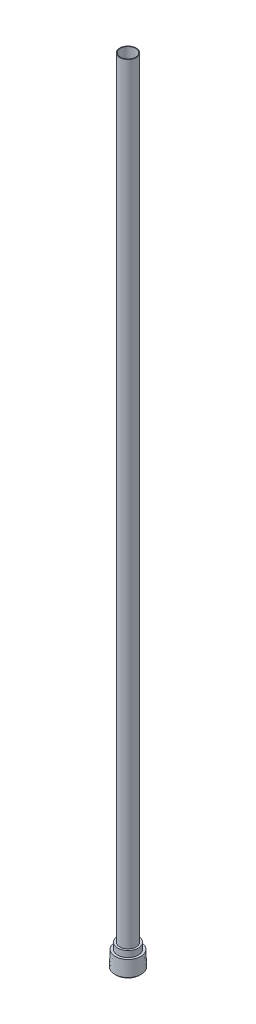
from build123d import *

# Parameters (mm, degrees)
CUT_EXTRUDE2_DEPTH = 4.7498
SKETCH2_R          = 2.921
CUT_EXTRUDE1_DEPTH = 300.0502
CHAMFER1_SIZE      = 0.508
CHAMFER1_SIZE2     = 0.49045616


with BuildPart() as part:
    # Sketch1 → Revolve1 (revolve)
    with BuildSketch(Plane(origin=(0, 0, 0), x_dir=(0, 0, -1), z_dir=(1, 0, 0)), mode=Mode.PRIVATE) as revolve1_sk:
        Polygon((0, 304.8), (0, 0), (5.0927, 0), (4.861187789, 6.35), (3.9624, 6.35), (3.9624, 8.7122), (3.175, 8.7122), (3.175, 304.8), align=None)
    revolve(revolve1_sk.sketch.rotate(Axis((0, 0, 0), (0, -1, 0)), 180), axis=Axis((0, 0, 0), (0, -1, 0)))

    # Sketch3 → Cut-Extrude2 (cut)
    with BuildSketch(Plane(origin=(0, 0, 0), x_dir=(-1, 0, 0), z_dir=(0, -1, 0))):
        Polygon((0, -2.742298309), (2.3749, -1.371149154), (2.3749, 1.371149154), (0, 2.742298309), (-2.3749, 1.371149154), (-2.3749, -1.371149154), align=None)
    extrude(amount=-CUT_EXTRUDE2_DEPTH, mode=Mode.SUBTRACT)

    # Sketch2 → Cut-Extrude1 (cut)
    with BuildSketch(Plane(origin=(0, 304.8, 0), x_dir=(1, 0, 0), z_dir=(0, 1, 0))):
        with Locations(Location((0, 0, 0), (0, 0, 270))):
            Circle(SKETCH2_R)
    extrude(amount=-CUT_EXTRUDE1_DEPTH, mode=Mode.SUBTRACT)

    # Chamfer1
    chamfer1_edges = [part.edges().sort_by_distance(p)[0] for p in [
        (0, 0, -5.0927),
    ]]
    chamfer1_side = [part.faces().sort_by_distance(p)[0] for p in [
        (0, 0, -4.948656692),
    ]]
    chamfer(chamfer1_edges, length=CHAMFER1_SIZE, length2=CHAMFER1_SIZE2, reference=chamfer1_side[0])


solid = part.part
